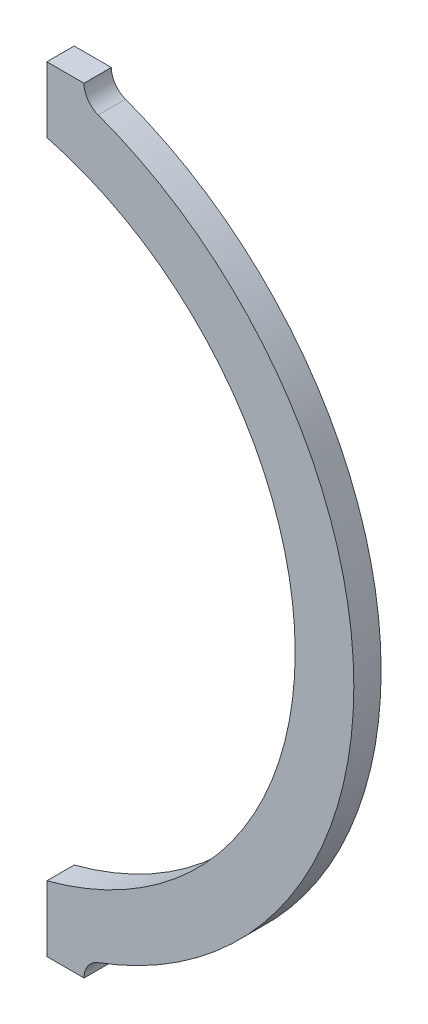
from build123d import *

# Parameters (mm, degrees)
EXTRUDE1_DEPTH = 2.615


with BuildPart() as part:
    # Sketch1 → Extrude1 (new, symmetric)
    with BuildSketch(Plane.XY):
        with BuildLine():
            Line((16.175, 74.251052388), (23.295, 74.251052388))
            ThreePointArc((23.295, 74.251052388), (24.042354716, 71.869996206), (26.01632061, 70.343095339))
            ThreePointArc((26.01632061, 70.343095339), (75, 0), (26.01632061, -70.343095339))
            ThreePointArc((26.01632061, -70.343095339), (24.042354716, -71.869996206), (23.295, -74.251052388))
            Line((23.295, -74.251052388), (16.175, -74.251052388))
            Line((16.175, -74.251052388), (16.175, -61.673024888))
            ThreePointArc((16.175, -61.673024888), (63.7588631, 0), (16.175, 61.673024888))
            Line((16.175, 61.673024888), (16.175, 74.251052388))
        make_face()
    extrude(amount=EXTRUDE1_DEPTH, both=True)


solid = part.part
